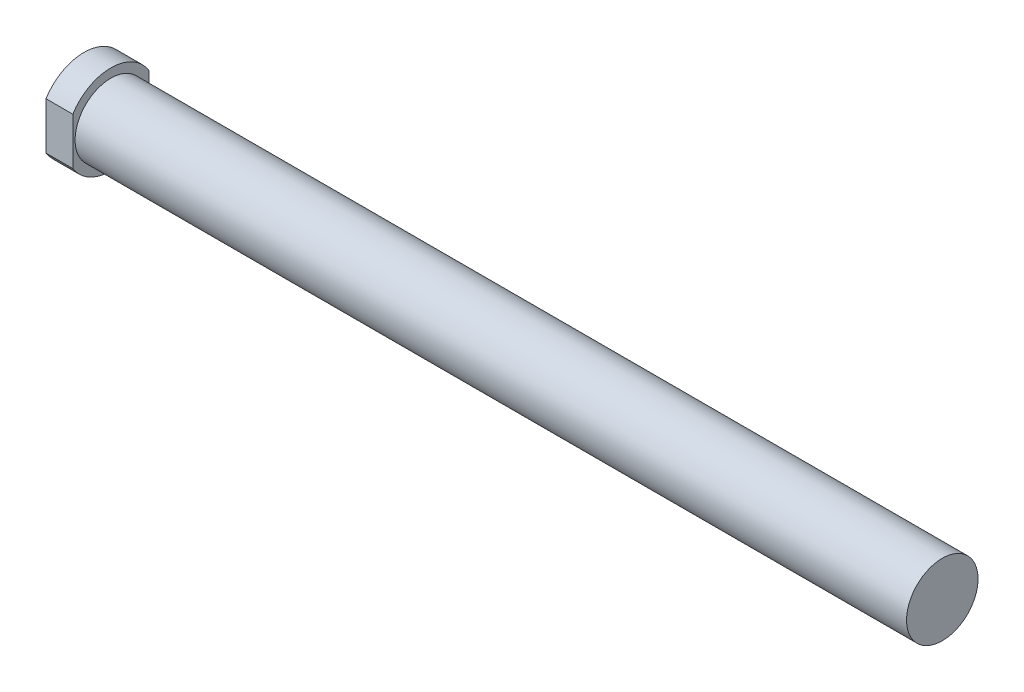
ISO-10303-21;
HEADER;
FILE_DESCRIPTION(('STEP AP214'),'2;1');
FILE_NAME('part.step','',(''),(''),'','','');
FILE_SCHEMA(('AUTOMOTIVE_DESIGN { 1 0 10303 214 1 1 1 1 }'));
ENDSEC;
DATA;
#1=APPLICATION_CONTEXT('core data for automotive mechanical design processes');
#2=APPLICATION_PROTOCOL_DEFINITION('international standard','automotive_design',2000,#1);
#3=PRODUCT_CONTEXT('',#1,'mechanical');
#4=PRODUCT('Part','Part','',(#3));
#5=PRODUCT_RELATED_PRODUCT_CATEGORY('part','',(#4));
#6=PRODUCT_DEFINITION_FORMATION('','',#4);
#7=PRODUCT_DEFINITION_CONTEXT('part definition',#1,'design');
#8=PRODUCT_DEFINITION('design','',#6,#7);
#9=PRODUCT_DEFINITION_SHAPE('','',#8);
#10=(LENGTH_UNIT() NAMED_UNIT(*) SI_UNIT(.MILLI.,.METRE.));
#11=(NAMED_UNIT(*) PLANE_ANGLE_UNIT() SI_UNIT($,.RADIAN.));
#12=(NAMED_UNIT(*) SI_UNIT($,.STERADIAN.) SOLID_ANGLE_UNIT());
#13=UNCERTAINTY_MEASURE_WITH_UNIT(LENGTH_MEASURE(1.E-05),#10,'distance_accuracy_value','');
#14=(GEOMETRIC_REPRESENTATION_CONTEXT(3) GLOBAL_UNCERTAINTY_ASSIGNED_CONTEXT((#13)) GLOBAL_UNIT_ASSIGNED_CONTEXT((#10,
#11,#12)) REPRESENTATION_CONTEXT('',''));
#15=CARTESIAN_POINT('',(0.,0.,0.));
#16=DIRECTION('',(0.,0.,1.));
#17=DIRECTION('',(1.,0.,0.));
#18=AXIS2_PLACEMENT_3D('',#15,#16,#17);
#19=CARTESIAN_POINT('',(0.,0.,0.));
#20=DIRECTION('',(1.,0.,0.));
#21=DIRECTION('',(0.,0.,-1.));
#22=AXIS2_PLACEMENT_3D('',#19,#20,#21);
#23=PLANE('',#22);
#24=DIRECTION('',(0.,-1.,0.));
#25=VECTOR('',#24,1.);
#26=CARTESIAN_POINT('',(0.,10.6481481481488,-8.5));
#27=LINE('',#26,#25);
#28=CARTESIAN_POINT('',(0.,5.26782687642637,-8.5));
#29=VERTEX_POINT('',#28);
#30=CARTESIAN_POINT('',(0.,-5.26782687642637,-8.5));
#31=VERTEX_POINT('',#30);
#32=EDGE_CURVE('E72',#29,#31,#27,.T.);
#33=ORIENTED_EDGE('',*,*,#32,.T.);
#34=CARTESIAN_POINT('',(0.,0.,0.));
#35=DIRECTION('',(-1.,0.,0.));
#36=DIRECTION('',(0.,0.,1.));
#37=AXIS2_PLACEMENT_3D('',#34,#35,#36);
#38=CIRCLE('',#37,10.);
#39=CARTESIAN_POINT('',(0.,-5.26782687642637,8.5));
#40=VERTEX_POINT('',#39);
#41=EDGE_CURVE('E79',#31,#40,#38,.T.);
#42=ORIENTED_EDGE('',*,*,#41,.T.);
#43=DIRECTION('',(0.,1.,0.));
#44=VECTOR('',#43,1.);
#45=CARTESIAN_POINT('',(0.,10.6481481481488,8.5));
#46=LINE('',#45,#44);
#47=CARTESIAN_POINT('',(0.,5.26782687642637,8.5));
#48=VERTEX_POINT('',#47);
#49=EDGE_CURVE('E64',#40,#48,#46,.T.);
#50=ORIENTED_EDGE('',*,*,#49,.T.);
#51=EDGE_CURVE('E84',#48,#29,#38,.T.);
#52=ORIENTED_EDGE('',*,*,#51,.T.);
#53=EDGE_LOOP('',(#33,#42,#50,#52));
#54=FACE_BOUND('',#53,.T.);
#55=ADVANCED_FACE('F27',(#54),#23,.F.);
#56=CARTESIAN_POINT('',(0.,0.,0.));
#57=DIRECTION('',(-1.,0.,0.));
#58=DIRECTION('',(0.,0.,1.));
#59=AXIS2_PLACEMENT_3D('',#56,#57,#58);
#60=CYLINDRICAL_SURFACE('',#59,10.);
#61=DIRECTION('',(-1.,0.,0.));
#62=VECTOR('',#61,1.);
#63=CARTESIAN_POINT('',(0.,-5.26782687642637,-8.5));
#64=LINE('',#63,#62);
#65=CARTESIAN_POINT('',(6.,-5.26782687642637,-8.5));
#66=VERTEX_POINT('',#65);
#67=EDGE_CURVE('E97',#66,#31,#64,.T.);
#68=ORIENTED_EDGE('',*,*,#67,.F.);
#69=CARTESIAN_POINT('',(6.,0.,0.));
#70=DIRECTION('',(-1.,0.,0.));
#71=DIRECTION('',(0.,0.,1.));
#72=AXIS2_PLACEMENT_3D('',#69,#70,#71);
#73=CIRCLE('',#72,10.);
#74=CARTESIAN_POINT('',(6.,-5.26782687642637,8.5));
#75=VERTEX_POINT('',#74);
#76=EDGE_CURVE('E81',#66,#75,#73,.T.);
#77=ORIENTED_EDGE('',*,*,#76,.T.);
#78=DIRECTION('',(-1.,0.,0.));
#79=VECTOR('',#78,1.);
#80=CARTESIAN_POINT('',(0.,-5.26782687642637,8.5));
#81=LINE('',#80,#79);
#82=EDGE_CURVE('E41',#40,#75,#81,.F.);
#83=ORIENTED_EDGE('',*,*,#82,.F.);
#84=ORIENTED_EDGE('',*,*,#41,.F.);
#85=EDGE_LOOP('',(#68,#77,#83,#84));
#86=FACE_BOUND('',#85,.T.);
#87=ADVANCED_FACE('F78',(#86),#60,.T.);
#88=DIRECTION('',(-1.,0.,0.));
#89=VECTOR('',#88,1.);
#90=CARTESIAN_POINT('',(0.,5.26782687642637,-8.5));
#91=LINE('',#90,#89);
#92=CARTESIAN_POINT('',(6.,5.26782687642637,-8.5));
#93=VERTEX_POINT('',#92);
#94=EDGE_CURVE('E48',#29,#93,#91,.F.);
#95=ORIENTED_EDGE('',*,*,#94,.F.);
#96=ORIENTED_EDGE('',*,*,#51,.F.);
#97=DIRECTION('',(-1.,0.,0.));
#98=VECTOR('',#97,1.);
#99=CARTESIAN_POINT('',(0.,5.26782687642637,8.5));
#100=LINE('',#99,#98);
#101=CARTESIAN_POINT('',(6.,5.26782687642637,8.5));
#102=VERTEX_POINT('',#101);
#103=EDGE_CURVE('E67',#102,#48,#100,.T.);
#104=ORIENTED_EDGE('',*,*,#103,.F.);
#105=EDGE_CURVE('E85',#102,#93,#73,.T.);
#106=ORIENTED_EDGE('',*,*,#105,.T.);
#107=EDGE_LOOP('',(#95,#96,#104,#106));
#108=FACE_BOUND('',#107,.T.);
#109=ADVANCED_FACE('F93',(#108),#60,.T.);
#110=CARTESIAN_POINT('',(6.,10.,0.));
#111=DIRECTION('',(-1.,0.,0.));
#112=DIRECTION('',(0.,0.,1.));
#113=AXIS2_PLACEMENT_3D('',#110,#111,#112);
#114=PLANE('',#113);
#115=CARTESIAN_POINT('',(6.,0.,0.));
#116=DIRECTION('',(-1.,0.,0.));
#117=DIRECTION('',(0.,0.,1.));
#118=AXIS2_PLACEMENT_3D('',#115,#116,#117);
#119=CIRCLE('',#118,8.);
#120=CARTESIAN_POINT('',(6.,0.,8.));
#121=VERTEX_POINT('',#120);
#122=EDGE_CURVE('E101',#121,#121,#119,.T.);
#123=ORIENTED_EDGE('',*,*,#122,.T.);
#124=EDGE_LOOP('',(#123));
#125=FACE_BOUND('',#124,.T.);
#126=DIRECTION('',(0.,-1.,0.));
#127=VECTOR('',#126,1.);
#128=CARTESIAN_POINT('',(6.,10.,-8.5));
#129=LINE('',#128,#127);
#130=EDGE_CURVE('E12',#93,#66,#129,.T.);
#131=ORIENTED_EDGE('',*,*,#130,.F.);
#132=ORIENTED_EDGE('',*,*,#105,.F.);
#133=DIRECTION('',(0.,1.,0.));
#134=VECTOR('',#133,1.);
#135=CARTESIAN_POINT('',(6.,10.,8.5));
#136=LINE('',#135,#134);
#137=EDGE_CURVE('E34',#75,#102,#136,.T.);
#138=ORIENTED_EDGE('',*,*,#137,.F.);
#139=ORIENTED_EDGE('',*,*,#76,.F.);
#140=EDGE_LOOP('',(#131,#132,#138,#139));
#141=FACE_BOUND('',#140,.T.);
#142=ADVANCED_FACE('F95',(#125,#141),#114,.F.);
#143=CARTESIAN_POINT('',(0.,0.,0.));
#144=DIRECTION('',(-1.,0.,0.));
#145=DIRECTION('',(0.,0.,1.));
#146=AXIS2_PLACEMENT_3D('',#143,#144,#145);
#147=CYLINDRICAL_SURFACE('',#146,8.);
#148=ORIENTED_EDGE('',*,*,#122,.F.);
#149=EDGE_LOOP('',(#148));
#150=FACE_BOUND('',#149,.T.);
#151=CARTESIAN_POINT('',(192.,0.,0.));
#152=DIRECTION('',(-1.,0.,0.));
#153=DIRECTION('',(0.,0.,1.));
#154=AXIS2_PLACEMENT_3D('',#151,#152,#153);
#155=CIRCLE('',#154,8.);
#156=CARTESIAN_POINT('',(192.,0.,8.));
#157=VERTEX_POINT('',#156);
#158=EDGE_CURVE('E98',#157,#157,#155,.T.);
#159=ORIENTED_EDGE('',*,*,#158,.T.);
#160=EDGE_LOOP('',(#159));
#161=FACE_BOUND('',#160,.T.);
#162=ADVANCED_FACE('F108',(#150,#161),#147,.T.);
#163=CARTESIAN_POINT('',(192.,8.,0.));
#164=DIRECTION('',(-1.,0.,0.));
#165=DIRECTION('',(0.,0.,1.));
#166=AXIS2_PLACEMENT_3D('',#163,#164,#165);
#167=PLANE('',#166);
#168=ORIENTED_EDGE('',*,*,#158,.F.);
#169=EDGE_LOOP('',(#168));
#170=FACE_BOUND('',#169,.T.);
#171=ADVANCED_FACE('F111',(#170),#167,.F.);
#172=CARTESIAN_POINT('',(6.,10.6481481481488,8.5));
#173=DIRECTION('',(0.,0.,1.));
#174=DIRECTION('',(0.,-1.,0.));
#175=AXIS2_PLACEMENT_3D('',#172,#173,#174);
#176=PLANE('',#175);
#177=ORIENTED_EDGE('',*,*,#103,.T.);
#178=ORIENTED_EDGE('',*,*,#49,.F.);
#179=ORIENTED_EDGE('',*,*,#82,.T.);
#180=ORIENTED_EDGE('',*,*,#137,.T.);
#181=EDGE_LOOP('',(#177,#178,#179,#180));
#182=FACE_BOUND('',#181,.T.);
#183=ADVANCED_FACE('F65',(#182),#176,.T.);
#184=CARTESIAN_POINT('',(6.,10.6481481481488,-8.5));
#185=DIRECTION('',(0.,0.,-1.));
#186=DIRECTION('',(0.,1.,0.));
#187=AXIS2_PLACEMENT_3D('',#184,#185,#186);
#188=PLANE('',#187);
#189=ORIENTED_EDGE('',*,*,#67,.T.);
#190=ORIENTED_EDGE('',*,*,#32,.F.);
#191=ORIENTED_EDGE('',*,*,#94,.T.);
#192=ORIENTED_EDGE('',*,*,#130,.T.);
#193=EDGE_LOOP('',(#189,#190,#191,#192));
#194=FACE_BOUND('',#193,.T.);
#195=ADVANCED_FACE('F96',(#194),#188,.T.);
#196=CLOSED_SHELL('',(#55,#87,#109,#142,#162,#171,#183,#195));
#197=MANIFOLD_SOLID_BREP('B2',#196);
#198=ADVANCED_BREP_SHAPE_REPRESENTATION('',(#18,#197),#14);
#199=SHAPE_DEFINITION_REPRESENTATION(#9,#198);
ENDSEC;
END-ISO-10303-21;
